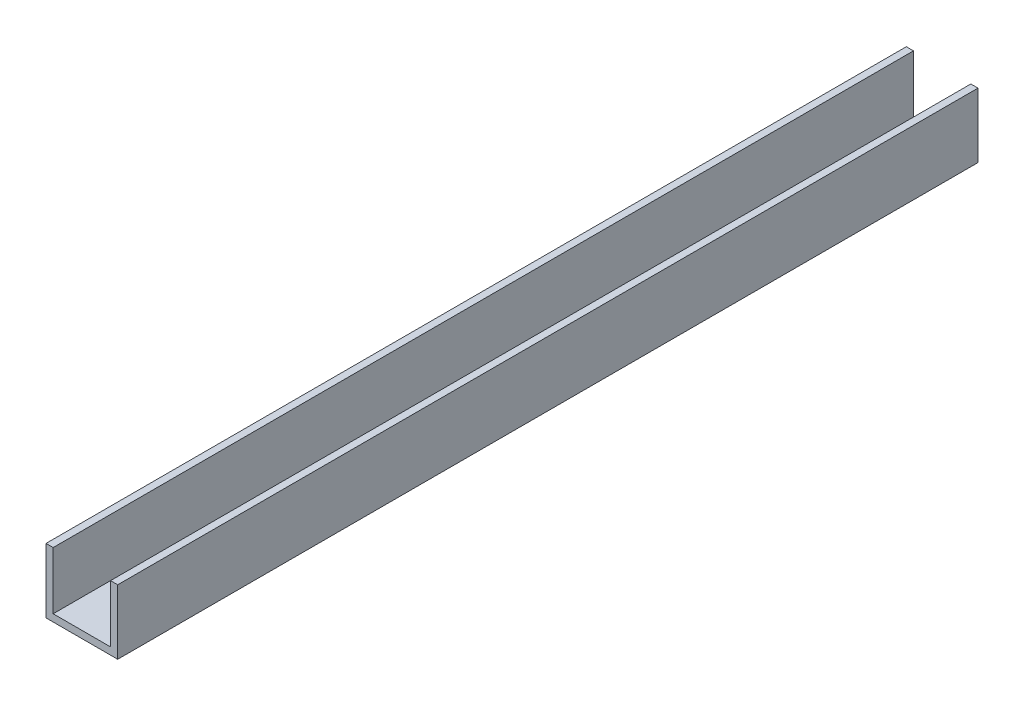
ISO-10303-21;
HEADER;
FILE_DESCRIPTION(('STEP AP214'),'2;1');
FILE_NAME('part.step','',(''),(''),'','','');
FILE_SCHEMA(('AUTOMOTIVE_DESIGN { 1 0 10303 214 1 1 1 1 }'));
ENDSEC;
DATA;
#1=APPLICATION_CONTEXT('core data for automotive mechanical design processes');
#2=APPLICATION_PROTOCOL_DEFINITION('international standard','automotive_design',2000,#1);
#3=PRODUCT_CONTEXT('',#1,'mechanical');
#4=PRODUCT('Part','Part','',(#3));
#5=PRODUCT_RELATED_PRODUCT_CATEGORY('part','',(#4));
#6=PRODUCT_DEFINITION_FORMATION('','',#4);
#7=PRODUCT_DEFINITION_CONTEXT('part definition',#1,'design');
#8=PRODUCT_DEFINITION('design','',#6,#7);
#9=PRODUCT_DEFINITION_SHAPE('','',#8);
#10=(LENGTH_UNIT() NAMED_UNIT(*) SI_UNIT(.MILLI.,.METRE.));
#11=(NAMED_UNIT(*) PLANE_ANGLE_UNIT() SI_UNIT($,.RADIAN.));
#12=(NAMED_UNIT(*) SI_UNIT($,.STERADIAN.) SOLID_ANGLE_UNIT());
#13=UNCERTAINTY_MEASURE_WITH_UNIT(LENGTH_MEASURE(1.E-05),#10,'distance_accuracy_value','');
#14=(GEOMETRIC_REPRESENTATION_CONTEXT(3) GLOBAL_UNCERTAINTY_ASSIGNED_CONTEXT((#13)) GLOBAL_UNIT_ASSIGNED_CONTEXT((#10,
#11,#12)) REPRESENTATION_CONTEXT('',''));
#15=CARTESIAN_POINT('',(0.,0.,0.));
#16=DIRECTION('',(0.,0.,1.));
#17=DIRECTION('',(1.,0.,0.));
#18=AXIS2_PLACEMENT_3D('',#15,#16,#17);
#19=CARTESIAN_POINT('',(-6.35,7.14375000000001,95.25));
#20=DIRECTION('',(0.,-1.,0.));
#21=DIRECTION('',(1.,0.,0.));
#22=AXIS2_PLACEMENT_3D('',#19,#20,#21);
#23=PLANE('',#22);
#24=DIRECTION('',(-1.,0.,0.));
#25=VECTOR('',#24,1.);
#26=CARTESIAN_POINT('',(-6.35,7.14375000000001,-95.25));
#27=LINE('',#26,#25);
#28=CARTESIAN_POINT('',(-6.35,7.14375000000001,-95.25));
#29=VERTEX_POINT('',#28);
#30=CARTESIAN_POINT('',(-7.9375,7.14375000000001,-95.25));
#31=VERTEX_POINT('',#30);
#32=EDGE_CURVE('E141',#29,#31,#27,.T.);
#33=ORIENTED_EDGE('',*,*,#32,.T.);
#34=DIRECTION('',(0.,0.,-1.));
#35=VECTOR('',#34,1.);
#36=CARTESIAN_POINT('',(-7.9375,7.14375000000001,95.25));
#37=LINE('',#36,#35);
#38=CARTESIAN_POINT('',(-7.9375,7.14375000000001,95.25));
#39=VERTEX_POINT('',#38);
#40=EDGE_CURVE('E11',#39,#31,#37,.T.);
#41=ORIENTED_EDGE('',*,*,#40,.F.);
#42=DIRECTION('',(-1.,0.,0.));
#43=VECTOR('',#42,1.);
#44=CARTESIAN_POINT('',(-6.35,7.14375000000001,95.25));
#45=LINE('',#44,#43);
#46=CARTESIAN_POINT('',(-6.35,7.14375000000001,95.25));
#47=VERTEX_POINT('',#46);
#48=EDGE_CURVE('E156',#47,#39,#45,.T.);
#49=ORIENTED_EDGE('',*,*,#48,.F.);
#50=DIRECTION('',(0.,0.,-1.));
#51=VECTOR('',#50,1.);
#52=CARTESIAN_POINT('',(-6.35,7.14375000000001,95.25));
#53=LINE('',#52,#51);
#54=EDGE_CURVE('E137',#47,#29,#53,.T.);
#55=ORIENTED_EDGE('',*,*,#54,.T.);
#56=EDGE_LOOP('',(#33,#41,#49,#55));
#57=FACE_BOUND('',#56,.T.);
#58=ADVANCED_FACE('F45',(#57),#23,.F.);
#59=CARTESIAN_POINT('',(-7.9375,7.14375000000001,95.25));
#60=DIRECTION('',(1.,0.,0.));
#61=DIRECTION('',(0.,1.,0.));
#62=AXIS2_PLACEMENT_3D('',#59,#60,#61);
#63=PLANE('',#62);
#64=DIRECTION('',(0.,-1.,0.));
#65=VECTOR('',#64,1.);
#66=CARTESIAN_POINT('',(-7.9375,7.14375000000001,-95.25));
#67=LINE('',#66,#65);
#68=CARTESIAN_POINT('',(-7.9375,-7.14374999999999,-95.25));
#69=VERTEX_POINT('',#68);
#70=EDGE_CURVE('E144',#31,#69,#67,.T.);
#71=ORIENTED_EDGE('',*,*,#70,.T.);
#72=DIRECTION('',(0.,0.,-1.));
#73=VECTOR('',#72,1.);
#74=CARTESIAN_POINT('',(-7.9375,-7.14374999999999,95.25));
#75=LINE('',#74,#73);
#76=CARTESIAN_POINT('',(-7.9375,-7.14374999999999,95.25));
#77=VERTEX_POINT('',#76);
#78=EDGE_CURVE('E53',#77,#69,#75,.T.);
#79=ORIENTED_EDGE('',*,*,#78,.F.);
#80=DIRECTION('',(0.,-1.,0.));
#81=VECTOR('',#80,1.);
#82=CARTESIAN_POINT('',(-7.9375,7.14375000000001,95.25));
#83=LINE('',#82,#81);
#84=EDGE_CURVE('E104',#39,#77,#83,.T.);
#85=ORIENTED_EDGE('',*,*,#84,.F.);
#86=ORIENTED_EDGE('',*,*,#40,.T.);
#87=EDGE_LOOP('',(#71,#79,#85,#86));
#88=FACE_BOUND('',#87,.T.);
#89=ADVANCED_FACE('F226',(#88),#63,.F.);
#90=CARTESIAN_POINT('',(-7.9375,-7.14374999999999,95.25));
#91=DIRECTION('',(0.,1.,0.));
#92=DIRECTION('',(-1.,0.,0.));
#93=AXIS2_PLACEMENT_3D('',#90,#91,#92);
#94=PLANE('',#93);
#95=CARTESIAN_POINT('',(0.,-7.14374999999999,79.375));
#96=DIRECTION('',(0.,1.,0.));
#97=DIRECTION('',(-1.,0.,0.));
#98=AXIS2_PLACEMENT_3D('',#95,#96,#97);
#99=CIRCLE('',#98,1.5875);
#100=CARTESIAN_POINT('',(-1.58749999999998,-7.14374999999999,79.375));
#101=VERTEX_POINT('',#100);
#102=EDGE_CURVE('E145',#101,#101,#99,.T.);
#103=ORIENTED_EDGE('',*,*,#102,.T.);
#104=EDGE_LOOP('',(#103));
#105=FACE_BOUND('',#104,.T.);
#106=CARTESIAN_POINT('',(0.,-7.14374999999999,-79.375));
#107=DIRECTION('',(0.,1.,0.));
#108=DIRECTION('',(-1.,0.,0.));
#109=AXIS2_PLACEMENT_3D('',#106,#107,#108);
#110=CIRCLE('',#109,1.5875);
#111=CARTESIAN_POINT('',(-1.5875,-7.14374999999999,-79.375));
#112=VERTEX_POINT('',#111);
#113=EDGE_CURVE('E189',#112,#112,#110,.T.);
#114=ORIENTED_EDGE('',*,*,#113,.T.);
#115=EDGE_LOOP('',(#114));
#116=FACE_BOUND('',#115,.T.);
#117=DIRECTION('',(1.,0.,0.));
#118=VECTOR('',#117,1.);
#119=CARTESIAN_POINT('',(-7.9375,-7.14374999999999,-95.25));
#120=LINE('',#119,#118);
#121=CARTESIAN_POINT('',(7.9375,-7.14374999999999,-95.25));
#122=VERTEX_POINT('',#121);
#123=EDGE_CURVE('E147',#69,#122,#120,.T.);
#124=ORIENTED_EDGE('',*,*,#123,.T.);
#125=DIRECTION('',(0.,0.,-1.));
#126=VECTOR('',#125,1.);
#127=CARTESIAN_POINT('',(7.9375,-7.14374999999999,95.25));
#128=LINE('',#127,#126);
#129=CARTESIAN_POINT('',(7.9375,-7.14374999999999,95.25));
#130=VERTEX_POINT('',#129);
#131=EDGE_CURVE('E163',#130,#122,#128,.T.);
#132=ORIENTED_EDGE('',*,*,#131,.F.);
#133=DIRECTION('',(1.,0.,0.));
#134=VECTOR('',#133,1.);
#135=CARTESIAN_POINT('',(-7.9375,-7.14374999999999,95.25));
#136=LINE('',#135,#134);
#137=EDGE_CURVE('E171',#77,#130,#136,.T.);
#138=ORIENTED_EDGE('',*,*,#137,.F.);
#139=ORIENTED_EDGE('',*,*,#78,.T.);
#140=EDGE_LOOP('',(#124,#132,#138,#139));
#141=FACE_BOUND('',#140,.T.);
#142=ADVANCED_FACE('F169',(#105,#116,#141),#94,.F.);
#143=CARTESIAN_POINT('',(7.9375,-7.14374999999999,95.25));
#144=DIRECTION('',(-1.,0.,0.));
#145=DIRECTION('',(0.,-1.,0.));
#146=AXIS2_PLACEMENT_3D('',#143,#144,#145);
#147=PLANE('',#146);
#148=DIRECTION('',(0.,1.,0.));
#149=VECTOR('',#148,1.);
#150=CARTESIAN_POINT('',(7.9375,-7.14374999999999,-95.25));
#151=LINE('',#150,#149);
#152=CARTESIAN_POINT('',(7.9375,7.14375000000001,-95.25));
#153=VERTEX_POINT('',#152);
#154=EDGE_CURVE('E149',#122,#153,#151,.T.);
#155=ORIENTED_EDGE('',*,*,#154,.T.);
#156=DIRECTION('',(0.,0.,-1.));
#157=VECTOR('',#156,1.);
#158=CARTESIAN_POINT('',(7.9375,7.14375000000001,95.25));
#159=LINE('',#158,#157);
#160=CARTESIAN_POINT('',(7.9375,7.14375000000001,95.25));
#161=VERTEX_POINT('',#160);
#162=EDGE_CURVE('E160',#161,#153,#159,.T.);
#163=ORIENTED_EDGE('',*,*,#162,.F.);
#164=DIRECTION('',(0.,1.,0.));
#165=VECTOR('',#164,1.);
#166=CARTESIAN_POINT('',(7.9375,-7.14374999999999,95.25));
#167=LINE('',#166,#165);
#168=EDGE_CURVE('E183',#130,#161,#167,.T.);
#169=ORIENTED_EDGE('',*,*,#168,.F.);
#170=ORIENTED_EDGE('',*,*,#131,.T.);
#171=EDGE_LOOP('',(#155,#163,#169,#170));
#172=FACE_BOUND('',#171,.T.);
#173=ADVANCED_FACE('F179',(#172),#147,.F.);
#174=CARTESIAN_POINT('',(7.9375,7.14375000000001,95.25));
#175=DIRECTION('',(0.,-1.,0.));
#176=DIRECTION('',(1.,0.,0.));
#177=AXIS2_PLACEMENT_3D('',#174,#175,#176);
#178=PLANE('',#177);
#179=DIRECTION('',(-1.,0.,0.));
#180=VECTOR('',#179,1.);
#181=CARTESIAN_POINT('',(7.9375,7.14375000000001,-95.25));
#182=LINE('',#181,#180);
#183=CARTESIAN_POINT('',(6.34999999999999,7.14375000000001,-95.25));
#184=VERTEX_POINT('',#183);
#185=EDGE_CURVE('E151',#153,#184,#182,.T.);
#186=ORIENTED_EDGE('',*,*,#185,.T.);
#187=DIRECTION('',(0.,0.,-1.));
#188=VECTOR('',#187,1.);
#189=CARTESIAN_POINT('',(6.34999999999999,7.14375000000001,95.25));
#190=LINE('',#189,#188);
#191=CARTESIAN_POINT('',(6.34999999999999,7.14375000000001,95.25));
#192=VERTEX_POINT('',#191);
#193=EDGE_CURVE('E132',#192,#184,#190,.T.);
#194=ORIENTED_EDGE('',*,*,#193,.F.);
#195=DIRECTION('',(-1.,0.,0.));
#196=VECTOR('',#195,1.);
#197=CARTESIAN_POINT('',(7.9375,7.14375000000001,95.25));
#198=LINE('',#197,#196);
#199=EDGE_CURVE('E123',#161,#192,#198,.T.);
#200=ORIENTED_EDGE('',*,*,#199,.F.);
#201=ORIENTED_EDGE('',*,*,#162,.T.);
#202=EDGE_LOOP('',(#186,#194,#200,#201));
#203=FACE_BOUND('',#202,.T.);
#204=ADVANCED_FACE('F182',(#203),#178,.F.);
#205=CARTESIAN_POINT('',(6.34999999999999,7.14375000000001,95.25));
#206=DIRECTION('',(1.,0.,0.));
#207=DIRECTION('',(0.,0.,-1.));
#208=AXIS2_PLACEMENT_3D('',#205,#206,#207);
#209=PLANE('',#208);
#210=DIRECTION('',(0.,-1.,0.));
#211=VECTOR('',#210,1.);
#212=CARTESIAN_POINT('',(6.34999999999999,7.14375000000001,-95.25));
#213=LINE('',#212,#211);
#214=CARTESIAN_POINT('',(6.34999999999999,-5.55624999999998,-95.25));
#215=VERTEX_POINT('',#214);
#216=EDGE_CURVE('E131',#184,#215,#213,.T.);
#217=ORIENTED_EDGE('',*,*,#216,.T.);
#218=DIRECTION('',(0.,0.,-1.));
#219=VECTOR('',#218,1.);
#220=CARTESIAN_POINT('',(6.34999999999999,-5.55624999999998,95.25));
#221=LINE('',#220,#219);
#222=CARTESIAN_POINT('',(6.34999999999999,-5.55624999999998,95.25));
#223=VERTEX_POINT('',#222);
#224=EDGE_CURVE('E128',#223,#215,#221,.T.);
#225=ORIENTED_EDGE('',*,*,#224,.F.);
#226=DIRECTION('',(0.,-1.,0.));
#227=VECTOR('',#226,1.);
#228=CARTESIAN_POINT('',(6.34999999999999,7.14375000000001,95.25));
#229=LINE('',#228,#227);
#230=EDGE_CURVE('E117',#192,#223,#229,.T.);
#231=ORIENTED_EDGE('',*,*,#230,.F.);
#232=ORIENTED_EDGE('',*,*,#193,.T.);
#233=EDGE_LOOP('',(#217,#225,#231,#232));
#234=FACE_BOUND('',#233,.T.);
#235=ADVANCED_FACE('F129',(#234),#209,.F.);
#236=CARTESIAN_POINT('',(6.34999999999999,-5.55624999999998,95.25));
#237=DIRECTION('',(0.,-1.,0.));
#238=DIRECTION('',(1.,0.,0.));
#239=AXIS2_PLACEMENT_3D('',#236,#237,#238);
#240=PLANE('',#239);
#241=CARTESIAN_POINT('',(0.,-5.55624999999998,79.375));
#242=DIRECTION('',(0.,1.,0.));
#243=DIRECTION('',(-1.,0.,0.));
#244=AXIS2_PLACEMENT_3D('',#241,#242,#243);
#245=CIRCLE('',#244,1.5875);
#246=CARTESIAN_POINT('',(-1.58749999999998,-5.55624999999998,79.375));
#247=VERTEX_POINT('',#246);
#248=EDGE_CURVE('E195',#247,#247,#245,.T.);
#249=ORIENTED_EDGE('',*,*,#248,.F.);
#250=EDGE_LOOP('',(#249));
#251=FACE_BOUND('',#250,.T.);
#252=CARTESIAN_POINT('',(0.,-5.55624999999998,-79.375));
#253=DIRECTION('',(0.,1.,0.));
#254=DIRECTION('',(-1.,0.,0.));
#255=AXIS2_PLACEMENT_3D('',#252,#253,#254);
#256=CIRCLE('',#255,1.5875);
#257=CARTESIAN_POINT('',(-1.5875,-5.55624999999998,-79.375));
#258=VERTEX_POINT('',#257);
#259=EDGE_CURVE('E192',#258,#258,#256,.T.);
#260=ORIENTED_EDGE('',*,*,#259,.F.);
#261=EDGE_LOOP('',(#260));
#262=FACE_BOUND('',#261,.T.);
#263=DIRECTION('',(-1.,0.,0.));
#264=VECTOR('',#263,1.);
#265=CARTESIAN_POINT('',(6.34999999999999,-5.55624999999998,-95.25));
#266=LINE('',#265,#264);
#267=CARTESIAN_POINT('',(-6.35,-5.55624999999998,-95.25));
#268=VERTEX_POINT('',#267);
#269=EDGE_CURVE('E90',#215,#268,#266,.T.);
#270=ORIENTED_EDGE('',*,*,#269,.T.);
#271=DIRECTION('',(0.,0.,-1.));
#272=VECTOR('',#271,1.);
#273=CARTESIAN_POINT('',(-6.35,-5.55624999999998,95.25));
#274=LINE('',#273,#272);
#275=CARTESIAN_POINT('',(-6.35,-5.55624999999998,95.25));
#276=VERTEX_POINT('',#275);
#277=EDGE_CURVE('E133',#276,#268,#274,.T.);
#278=ORIENTED_EDGE('',*,*,#277,.F.);
#279=DIRECTION('',(-1.,0.,0.));
#280=VECTOR('',#279,1.);
#281=CARTESIAN_POINT('',(6.34999999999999,-5.55624999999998,95.25));
#282=LINE('',#281,#280);
#283=EDGE_CURVE('E121',#223,#276,#282,.T.);
#284=ORIENTED_EDGE('',*,*,#283,.F.);
#285=ORIENTED_EDGE('',*,*,#224,.T.);
#286=EDGE_LOOP('',(#270,#278,#284,#285));
#287=FACE_BOUND('',#286,.T.);
#288=ADVANCED_FACE('F135',(#251,#262,#287),#240,.F.);
#289=CARTESIAN_POINT('',(-6.35,-5.55624999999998,95.25));
#290=DIRECTION('',(-1.,0.,0.));
#291=DIRECTION('',(0.,0.,1.));
#292=AXIS2_PLACEMENT_3D('',#289,#290,#291);
#293=PLANE('',#292);
#294=DIRECTION('',(0.,1.,0.));
#295=VECTOR('',#294,1.);
#296=CARTESIAN_POINT('',(-6.35,-5.55624999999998,-95.25));
#297=LINE('',#296,#295);
#298=EDGE_CURVE('E96',#268,#29,#297,.T.);
#299=ORIENTED_EDGE('',*,*,#298,.T.);
#300=ORIENTED_EDGE('',*,*,#54,.F.);
#301=DIRECTION('',(0.,1.,0.));
#302=VECTOR('',#301,1.);
#303=CARTESIAN_POINT('',(-6.35,-5.55624999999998,95.25));
#304=LINE('',#303,#302);
#305=EDGE_CURVE('E61',#276,#47,#304,.T.);
#306=ORIENTED_EDGE('',*,*,#305,.F.);
#307=ORIENTED_EDGE('',*,*,#277,.T.);
#308=EDGE_LOOP('',(#299,#300,#306,#307));
#309=FACE_BOUND('',#308,.T.);
#310=ADVANCED_FACE('F212',(#309),#293,.F.);
#311=CARTESIAN_POINT('',(0.,0.,95.25));
#312=DIRECTION('',(0.,0.,1.));
#313=DIRECTION('',(1.,0.,0.));
#314=AXIS2_PLACEMENT_3D('',#311,#312,#313);
#315=PLANE('',#314);
#316=ORIENTED_EDGE('',*,*,#48,.T.);
#317=ORIENTED_EDGE('',*,*,#84,.T.);
#318=ORIENTED_EDGE('',*,*,#137,.T.);
#319=ORIENTED_EDGE('',*,*,#168,.T.);
#320=ORIENTED_EDGE('',*,*,#199,.T.);
#321=ORIENTED_EDGE('',*,*,#230,.T.);
#322=ORIENTED_EDGE('',*,*,#283,.T.);
#323=ORIENTED_EDGE('',*,*,#305,.T.);
#324=EDGE_LOOP('',(#316,#317,#318,#319,#320,#321,#322,#323));
#325=FACE_BOUND('',#324,.T.);
#326=ADVANCED_FACE('F119',(#325),#315,.T.);
#327=CARTESIAN_POINT('',(0.,0.,-95.25));
#328=DIRECTION('',(0.,0.,1.));
#329=DIRECTION('',(1.,0.,0.));
#330=AXIS2_PLACEMENT_3D('',#327,#328,#329);
#331=PLANE('',#330);
#332=ORIENTED_EDGE('',*,*,#32,.F.);
#333=ORIENTED_EDGE('',*,*,#298,.F.);
#334=ORIENTED_EDGE('',*,*,#269,.F.);
#335=ORIENTED_EDGE('',*,*,#216,.F.);
#336=ORIENTED_EDGE('',*,*,#185,.F.);
#337=ORIENTED_EDGE('',*,*,#154,.F.);
#338=ORIENTED_EDGE('',*,*,#123,.F.);
#339=ORIENTED_EDGE('',*,*,#70,.F.);
#340=EDGE_LOOP('',(#332,#333,#334,#335,#336,#337,#338,#339));
#341=FACE_BOUND('',#340,.T.);
#342=ADVANCED_FACE('F175',(#341),#331,.F.);
#343=CARTESIAN_POINT('',(0.,-7.14374999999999,-79.375));
#344=DIRECTION('',(0.,1.,0.));
#345=DIRECTION('',(-1.,0.,0.));
#346=AXIS2_PLACEMENT_3D('',#343,#344,#345);
#347=CYLINDRICAL_SURFACE('',#346,1.5875);
#348=ORIENTED_EDGE('',*,*,#113,.F.);
#349=EDGE_LOOP('',(#348));
#350=FACE_BOUND('',#349,.T.);
#351=ORIENTED_EDGE('',*,*,#259,.T.);
#352=EDGE_LOOP('',(#351));
#353=FACE_BOUND('',#352,.T.);
#354=ADVANCED_FACE('F206',(#350,#353),#347,.F.);
#355=CARTESIAN_POINT('',(0.,-7.14374999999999,79.375));
#356=DIRECTION('',(0.,1.,0.));
#357=DIRECTION('',(-1.,0.,0.));
#358=AXIS2_PLACEMENT_3D('',#355,#356,#357);
#359=CYLINDRICAL_SURFACE('',#358,1.5875);
#360=ORIENTED_EDGE('',*,*,#102,.F.);
#361=EDGE_LOOP('',(#360));
#362=FACE_BOUND('',#361,.T.);
#363=ORIENTED_EDGE('',*,*,#248,.T.);
#364=EDGE_LOOP('',(#363));
#365=FACE_BOUND('',#364,.T.);
#366=ADVANCED_FACE('F203',(#362,#365),#359,.F.);
#367=CLOSED_SHELL('',(#58,#89,#142,#173,#204,#235,#288,#310,#326,#342,#354,#366));
#368=MANIFOLD_SOLID_BREP('B2',#367);
#369=ADVANCED_BREP_SHAPE_REPRESENTATION('',(#18,#368),#14);
#370=SHAPE_DEFINITION_REPRESENTATION(#9,#369);
ENDSEC;
END-ISO-10303-21;
